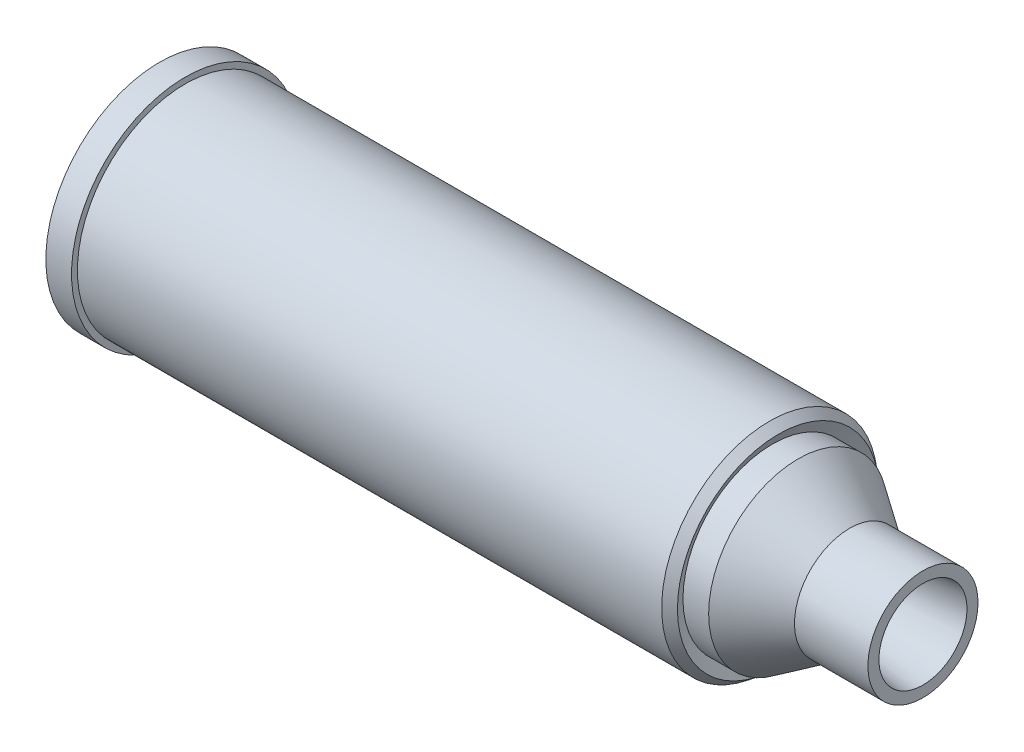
ISO-10303-21;
HEADER;
FILE_DESCRIPTION(('STEP AP214'),'2;1');
FILE_NAME('part.step','',(''),(''),'','','');
FILE_SCHEMA(('AUTOMOTIVE_DESIGN { 1 0 10303 214 1 1 1 1 }'));
ENDSEC;
DATA;
#1=APPLICATION_CONTEXT('core data for automotive mechanical design processes');
#2=APPLICATION_PROTOCOL_DEFINITION('international standard','automotive_design',2000,#1);
#3=PRODUCT_CONTEXT('',#1,'mechanical');
#4=PRODUCT('Part','Part','',(#3));
#5=PRODUCT_RELATED_PRODUCT_CATEGORY('part','',(#4));
#6=PRODUCT_DEFINITION_FORMATION('','',#4);
#7=PRODUCT_DEFINITION_CONTEXT('part definition',#1,'design');
#8=PRODUCT_DEFINITION('design','',#6,#7);
#9=PRODUCT_DEFINITION_SHAPE('','',#8);
#10=(LENGTH_UNIT() NAMED_UNIT(*) SI_UNIT(.MILLI.,.METRE.));
#11=(NAMED_UNIT(*) PLANE_ANGLE_UNIT() SI_UNIT($,.RADIAN.));
#12=(NAMED_UNIT(*) SI_UNIT($,.STERADIAN.) SOLID_ANGLE_UNIT());
#13=UNCERTAINTY_MEASURE_WITH_UNIT(LENGTH_MEASURE(1.E-05),#10,'distance_accuracy_value','');
#14=(GEOMETRIC_REPRESENTATION_CONTEXT(3) GLOBAL_UNCERTAINTY_ASSIGNED_CONTEXT((#13)) GLOBAL_UNIT_ASSIGNED_CONTEXT((#10,
#11,#12)) REPRESENTATION_CONTEXT('',''));
#15=CARTESIAN_POINT('',(0.,0.,0.));
#16=DIRECTION('',(0.,0.,1.));
#17=DIRECTION('',(1.,0.,0.));
#18=AXIS2_PLACEMENT_3D('',#15,#16,#17);
#19=CARTESIAN_POINT('',(43.9095744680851,0.,0.));
#20=DIRECTION('',(1.,0.,0.));
#21=DIRECTION('',(0.,0.,-1.));
#22=AXIS2_PLACEMENT_3D('',#19,#20,#21);
#23=CYLINDRICAL_SURFACE('',#22,9.15000000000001);
#24=CARTESIAN_POINT('',(0.,0.,0.));
#25=DIRECTION('',(1.,0.,0.));
#26=DIRECTION('',(0.,0.,-1.));
#27=AXIS2_PLACEMENT_3D('',#24,#25,#26);
#28=CIRCLE('',#27,9.15000000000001);
#29=CARTESIAN_POINT('',(0.,0.,-9.15000000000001));
#30=VERTEX_POINT('',#29);
#31=EDGE_CURVE('E18',#30,#30,#28,.T.);
#32=ORIENTED_EDGE('',*,*,#31,.F.);
#33=EDGE_LOOP('',(#32));
#34=FACE_BOUND('',#33,.T.);
#35=CARTESIAN_POINT('',(87.8191489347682,0.,0.));
#36=DIRECTION('',(-1.,0.,0.));
#37=DIRECTION('',(0.,1.,0.));
#38=AXIS2_PLACEMENT_3D('',#35,#36,#37);
#39=CIRCLE('',#38,9.14999999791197);
#40=CARTESIAN_POINT('',(87.8191489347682,9.14999999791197,0.));
#41=VERTEX_POINT('',#40);
#42=EDGE_CURVE('E31',#41,#41,#39,.F.);
#43=ORIENTED_EDGE('',*,*,#42,.T.);
#44=EDGE_LOOP('',(#43));
#45=FACE_BOUND('',#44,.T.);
#46=ADVANCED_FACE('F14',(#34,#45),#23,.F.);
#47=CARTESIAN_POINT('',(87.8191489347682,0.,0.));
#48=DIRECTION('',(-1.,0.,0.));
#49=DIRECTION('',(0.,0.,1.));
#50=AXIS2_PLACEMENT_3D('',#47,#48,#49);
#51=CONICAL_SURFACE('',#50,9.14999999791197,0.591292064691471);
#52=ORIENTED_EDGE('',*,*,#42,.F.);
#53=EDGE_LOOP('',(#52));
#54=FACE_BOUND('',#53,.T.);
#55=CARTESIAN_POINT('',(93.9999999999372,0.,0.));
#56=DIRECTION('',(1.,0.,0.));
#57=DIRECTION('',(0.,1.,0.));
#58=AXIS2_PLACEMENT_3D('',#55,#56,#57);
#59=CIRCLE('',#58,5.0000000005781);
#60=CARTESIAN_POINT('',(93.9999999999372,5.0000000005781,0.));
#61=VERTEX_POINT('',#60);
#62=EDGE_CURVE('E59',#61,#61,#59,.T.);
#63=ORIENTED_EDGE('',*,*,#62,.T.);
#64=EDGE_LOOP('',(#63));
#65=FACE_BOUND('',#64,.T.);
#66=ADVANCED_FACE('F157',(#54,#65),#51,.F.);
#67=CARTESIAN_POINT('',(0.,9.65,0.));
#68=DIRECTION('',(-1.,0.,0.));
#69=DIRECTION('',(0.,0.,1.));
#70=AXIS2_PLACEMENT_3D('',#67,#68,#69);
#71=PLANE('',#70);
#72=ORIENTED_EDGE('',*,*,#31,.T.);
#73=EDGE_LOOP('',(#72));
#74=FACE_BOUND('',#73,.T.);
#75=CARTESIAN_POINT('',(-9.02194985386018E-11,0.,0.));
#76=DIRECTION('',(1.,0.,0.));
#77=DIRECTION('',(0.,0.,-1.));
#78=AXIS2_PLACEMENT_3D('',#75,#76,#77);
#79=CIRCLE('',#78,9.35000000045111);
#80=CARTESIAN_POINT('',(-9.02194985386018E-11,0.,-9.35000000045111));
#81=VERTEX_POINT('',#80);
#82=EDGE_CURVE('E57',#81,#81,#79,.T.);
#83=ORIENTED_EDGE('',*,*,#82,.F.);
#84=EDGE_LOOP('',(#83));
#85=FACE_BOUND('',#84,.T.);
#86=ADVANCED_FACE('F152',(#74,#85),#71,.T.);
#87=CARTESIAN_POINT('',(104.000000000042,0.,0.));
#88=DIRECTION('',(1.,0.,0.));
#89=DIRECTION('',(0.,0.,-1.));
#90=AXIS2_PLACEMENT_3D('',#87,#88,#89);
#91=CONICAL_SURFACE('',#90,5.9999999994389,0.0996686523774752);
#92=ORIENTED_EDGE('',*,*,#62,.F.);
#93=EDGE_LOOP('',(#92));
#94=FACE_BOUND('',#93,.T.);
#95=CARTESIAN_POINT('',(104.000000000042,0.,0.));
#96=DIRECTION('',(1.,0.,0.));
#97=DIRECTION('',(0.,0.,-1.));
#98=AXIS2_PLACEMENT_3D('',#95,#96,#97);
#99=CIRCLE('',#98,5.9999999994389);
#100=CARTESIAN_POINT('',(104.000000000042,0.,-5.9999999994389));
#101=VERTEX_POINT('',#100);
#102=EDGE_CURVE('E55',#101,#101,#99,.F.);
#103=ORIENTED_EDGE('',*,*,#102,.F.);
#104=EDGE_LOOP('',(#103));
#105=FACE_BOUND('',#104,.T.);
#106=ADVANCED_FACE('F148',(#94,#105),#91,.F.);
#107=CARTESIAN_POINT('',(4.00000000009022,0.,0.));
#108=DIRECTION('',(1.,0.,0.));
#109=DIRECTION('',(0.,0.,-1.));
#110=AXIS2_PLACEMENT_3D('',#107,#108,#109);
#111=CONICAL_SURFACE('',#110,10.1499999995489,0.197395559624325);
#112=ORIENTED_EDGE('',*,*,#82,.T.);
#113=EDGE_LOOP('',(#112));
#114=FACE_BOUND('',#113,.T.);
#115=CARTESIAN_POINT('',(4.,0.,0.));
#116=DIRECTION('',(1.,0.,0.));
#117=DIRECTION('',(0.,0.,-1.));
#118=AXIS2_PLACEMENT_3D('',#115,#116,#117);
#119=CIRCLE('',#118,10.15);
#120=CARTESIAN_POINT('',(4.,0.,-10.15));
#121=VERTEX_POINT('',#120);
#122=EDGE_CURVE('E54',#121,#121,#119,.T.);
#123=ORIENTED_EDGE('',*,*,#122,.F.);
#124=EDGE_LOOP('',(#123));
#125=FACE_BOUND('',#124,.T.);
#126=ADVANCED_FACE('F143',(#114,#125),#111,.T.);
#127=CARTESIAN_POINT('',(104.,6.75,0.));
#128=DIRECTION('',(1.,0.,0.));
#129=DIRECTION('',(0.,0.,-1.));
#130=AXIS2_PLACEMENT_3D('',#127,#128,#129);
#131=PLANE('',#130);
#132=ORIENTED_EDGE('',*,*,#102,.T.);
#133=EDGE_LOOP('',(#132));
#134=FACE_BOUND('',#133,.T.);
#135=CARTESIAN_POINT('',(104.,0.,0.));
#136=DIRECTION('',(1.,0.,0.));
#137=DIRECTION('',(0.,0.,-1.));
#138=AXIS2_PLACEMENT_3D('',#135,#136,#137);
#139=CIRCLE('',#138,7.50000000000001);
#140=CARTESIAN_POINT('',(104.,0.,-7.50000000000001));
#141=VERTEX_POINT('',#140);
#142=EDGE_CURVE('E51',#141,#141,#139,.F.);
#143=ORIENTED_EDGE('',*,*,#142,.F.);
#144=EDGE_LOOP('',(#143));
#145=FACE_BOUND('',#144,.T.);
#146=ADVANCED_FACE('F138',(#134,#145),#131,.T.);
#147=CARTESIAN_POINT('',(40.,0.,0.));
#148=DIRECTION('',(1.,0.,0.));
#149=DIRECTION('',(0.,0.,-1.));
#150=AXIS2_PLACEMENT_3D('',#147,#148,#149);
#151=CYLINDRICAL_SURFACE('',#150,10.15);
#152=CARTESIAN_POINT('',(80.,0.,0.));
#153=DIRECTION('',(1.,0.,0.));
#154=DIRECTION('',(0.,0.,-1.));
#155=AXIS2_PLACEMENT_3D('',#152,#153,#154);
#156=CIRCLE('',#155,10.15);
#157=CARTESIAN_POINT('',(80.,0.,-10.15));
#158=VERTEX_POINT('',#157);
#159=EDGE_CURVE('E48',#158,#158,#156,.T.);
#160=ORIENTED_EDGE('',*,*,#159,.F.);
#161=EDGE_LOOP('',(#160));
#162=FACE_BOUND('',#161,.T.);
#163=ORIENTED_EDGE('',*,*,#122,.T.);
#164=EDGE_LOOP('',(#163));
#165=FACE_BOUND('',#164,.T.);
#166=ADVANCED_FACE('F133',(#162,#165),#151,.T.);
#167=CARTESIAN_POINT('',(99.,0.,0.));
#168=DIRECTION('',(1.,0.,0.));
#169=DIRECTION('',(0.,0.,-1.));
#170=AXIS2_PLACEMENT_3D('',#167,#168,#169);
#171=CYLINDRICAL_SURFACE('',#170,7.50000000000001);
#172=ORIENTED_EDGE('',*,*,#142,.T.);
#173=EDGE_LOOP('',(#172));
#174=FACE_BOUND('',#173,.T.);
#175=CARTESIAN_POINT('',(94.0000000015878,0.,0.));
#176=DIRECTION('',(-1.,0.,0.));
#177=DIRECTION('',(0.,1.,0.));
#178=AXIS2_PLACEMENT_3D('',#175,#176,#177);
#179=CIRCLE('',#178,7.50000000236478);
#180=CARTESIAN_POINT('',(94.0000000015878,7.50000000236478,0.));
#181=VERTEX_POINT('',#180);
#182=EDGE_CURVE('E47',#181,#181,#179,.T.);
#183=ORIENTED_EDGE('',*,*,#182,.F.);
#184=EDGE_LOOP('',(#183));
#185=FACE_BOUND('',#184,.T.);
#186=ADVANCED_FACE('F128',(#174,#185),#171,.T.);
#187=CARTESIAN_POINT('',(80.,11.825,0.));
#188=DIRECTION('',(-1.,0.,0.));
#189=DIRECTION('',(0.,0.,1.));
#190=AXIS2_PLACEMENT_3D('',#187,#188,#189);
#191=PLANE('',#190);
#192=ORIENTED_EDGE('',*,*,#159,.T.);
#193=EDGE_LOOP('',(#192));
#194=FACE_BOUND('',#193,.T.);
#195=CARTESIAN_POINT('',(80.,0.,0.));
#196=DIRECTION('',(1.,0.,0.));
#197=DIRECTION('',(0.,0.,-1.));
#198=AXIS2_PLACEMENT_3D('',#195,#196,#197);
#199=CIRCLE('',#198,13.5);
#200=CARTESIAN_POINT('',(80.,0.,-13.5));
#201=VERTEX_POINT('',#200);
#202=EDGE_CURVE('E44',#201,#201,#199,.F.);
#203=ORIENTED_EDGE('',*,*,#202,.T.);
#204=EDGE_LOOP('',(#203));
#205=FACE_BOUND('',#204,.T.);
#206=ADVANCED_FACE('F123',(#194,#205),#191,.T.);
#207=CARTESIAN_POINT('',(86.9999999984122,0.,0.));
#208=DIRECTION('',(-1.,0.,0.));
#209=DIRECTION('',(0.,0.,1.));
#210=AXIS2_PLACEMENT_3D('',#207,#208,#209);
#211=CONICAL_SURFACE('',#210,12.1999999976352,0.591292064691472);
#212=ORIENTED_EDGE('',*,*,#182,.T.);
#213=EDGE_LOOP('',(#212));
#214=FACE_BOUND('',#213,.T.);
#215=CARTESIAN_POINT('',(87.,0.,0.));
#216=DIRECTION('',(1.,0.,0.));
#217=DIRECTION('',(0.,0.,-1.));
#218=AXIS2_PLACEMENT_3D('',#215,#216,#217);
#219=CIRCLE('',#218,12.2);
#220=CARTESIAN_POINT('',(87.,0.,-12.2));
#221=VERTEX_POINT('',#220);
#222=EDGE_CURVE('E43',#221,#221,#219,.F.);
#223=ORIENTED_EDGE('',*,*,#222,.F.);
#224=EDGE_LOOP('',(#223));
#225=FACE_BOUND('',#224,.T.);
#226=ADVANCED_FACE('F118',(#214,#225),#211,.T.);
#227=CARTESIAN_POINT('',(40.,0.,0.));
#228=DIRECTION('',(1.,0.,0.));
#229=DIRECTION('',(0.,0.,-1.));
#230=AXIS2_PLACEMENT_3D('',#227,#228,#229);
#231=CYLINDRICAL_SURFACE('',#230,13.5);
#232=CARTESIAN_POINT('',(0.,0.,0.));
#233=DIRECTION('',(1.,0.,0.));
#234=DIRECTION('',(0.,0.,-1.));
#235=AXIS2_PLACEMENT_3D('',#232,#233,#234);
#236=CIRCLE('',#235,13.5);
#237=CARTESIAN_POINT('',(0.,0.,-13.5));
#238=VERTEX_POINT('',#237);
#239=EDGE_CURVE('E40',#238,#238,#236,.T.);
#240=ORIENTED_EDGE('',*,*,#239,.F.);
#241=EDGE_LOOP('',(#240));
#242=FACE_BOUND('',#241,.T.);
#243=ORIENTED_EDGE('',*,*,#202,.F.);
#244=EDGE_LOOP('',(#243));
#245=FACE_BOUND('',#244,.T.);
#246=ADVANCED_FACE('F113',(#242,#245),#231,.F.);
#247=CARTESIAN_POINT('',(85.25,0.,0.));
#248=DIRECTION('',(1.,0.,0.));
#249=DIRECTION('',(0.,0.,-1.));
#250=AXIS2_PLACEMENT_3D('',#247,#248,#249);
#251=CYLINDRICAL_SURFACE('',#250,12.2);
#252=ORIENTED_EDGE('',*,*,#222,.T.);
#253=EDGE_LOOP('',(#252));
#254=FACE_BOUND('',#253,.T.);
#255=CARTESIAN_POINT('',(83.4999999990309,0.,0.));
#256=DIRECTION('',(1.,0.,0.));
#257=DIRECTION('',(0.,1.,0.));
#258=AXIS2_PLACEMENT_3D('',#255,#256,#257);
#259=CIRCLE('',#258,12.2000000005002);
#260=CARTESIAN_POINT('',(83.4999999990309,12.2000000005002,0.));
#261=VERTEX_POINT('',#260);
#262=EDGE_CURVE('E39',#261,#261,#259,.T.);
#263=ORIENTED_EDGE('',*,*,#262,.T.);
#264=EDGE_LOOP('',(#263));
#265=FACE_BOUND('',#264,.T.);
#266=ADVANCED_FACE('F92',(#254,#265),#251,.T.);
#267=CARTESIAN_POINT('',(0.,14.5,0.));
#268=DIRECTION('',(-1.,0.,0.));
#269=DIRECTION('',(0.,0.,1.));
#270=AXIS2_PLACEMENT_3D('',#267,#268,#269);
#271=PLANE('',#270);
#272=ORIENTED_EDGE('',*,*,#239,.T.);
#273=EDGE_LOOP('',(#272));
#274=FACE_BOUND('',#273,.T.);
#275=CARTESIAN_POINT('',(0.,0.,0.));
#276=DIRECTION('',(1.,0.,0.));
#277=DIRECTION('',(0.,0.,-1.));
#278=AXIS2_PLACEMENT_3D('',#275,#276,#277);
#279=CIRCLE('',#278,15.5);
#280=CARTESIAN_POINT('',(0.,0.,-15.5));
#281=VERTEX_POINT('',#280);
#282=EDGE_CURVE('E36',#281,#281,#279,.T.);
#283=ORIENTED_EDGE('',*,*,#282,.F.);
#284=EDGE_LOOP('',(#283));
#285=FACE_BOUND('',#284,.T.);
#286=ADVANCED_FACE('F83',(#274,#285),#271,.T.);
#287=CARTESIAN_POINT('',(84.3000000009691,0.,0.));
#288=DIRECTION('',(1.,0.,0.));
#289=DIRECTION('',(0.,0.,-1.));
#290=AXIS2_PLACEMENT_3D('',#287,#288,#289);
#291=CONICAL_SURFACE('',#290,13.7499999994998,1.09432890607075);
#292=ORIENTED_EDGE('',*,*,#262,.F.);
#293=EDGE_LOOP('',(#292));
#294=FACE_BOUND('',#293,.T.);
#295=CARTESIAN_POINT('',(84.3000000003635,0.,0.));
#296=DIRECTION('',(-1.,0.,0.));
#297=DIRECTION('',(0.,-1.,0.));
#298=AXIS2_PLACEMENT_3D('',#295,#296,#297);
#299=CIRCLE('',#298,13.7500000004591);
#300=CARTESIAN_POINT('',(84.3000000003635,-13.7500000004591,0.));
#301=VERTEX_POINT('',#300);
#302=EDGE_CURVE('E35',#301,#301,#299,.T.);
#303=ORIENTED_EDGE('',*,*,#302,.F.);
#304=EDGE_LOOP('',(#303));
#305=FACE_BOUND('',#304,.T.);
#306=ADVANCED_FACE('F80',(#294,#305),#291,.F.);
#307=CARTESIAN_POINT('',(1.75,0.,0.));
#308=DIRECTION('',(1.,0.,0.));
#309=DIRECTION('',(0.,0.,-1.));
#310=AXIS2_PLACEMENT_3D('',#307,#308,#309);
#311=CYLINDRICAL_SURFACE('',#310,15.5);
#312=CARTESIAN_POINT('',(3.5,0.,0.));
#313=DIRECTION('',(1.,0.,0.));
#314=DIRECTION('',(0.,0.,-1.));
#315=AXIS2_PLACEMENT_3D('',#312,#313,#314);
#316=CIRCLE('',#315,15.5);
#317=CARTESIAN_POINT('',(3.5,0.,-15.5));
#318=VERTEX_POINT('',#317);
#319=EDGE_CURVE('E27',#318,#318,#316,.T.);
#320=ORIENTED_EDGE('',*,*,#319,.F.);
#321=EDGE_LOOP('',(#320));
#322=FACE_BOUND('',#321,.T.);
#323=ORIENTED_EDGE('',*,*,#282,.T.);
#324=EDGE_LOOP('',(#323));
#325=FACE_BOUND('',#324,.T.);
#326=ADVANCED_FACE('F82',(#322,#325),#311,.T.);
#327=CARTESIAN_POINT('',(83.0999999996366,0.,0.));
#328=DIRECTION('',(-1.,0.,0.));
#329=DIRECTION('',(0.,0.,1.));
#330=AXIS2_PLACEMENT_3D('',#327,#328,#329);
#331=CONICAL_SURFACE('',#330,14.6999999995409,0.669638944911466);
#332=CARTESIAN_POINT('',(83.1,0.,0.));
#333=DIRECTION('',(1.,0.,0.));
#334=DIRECTION('',(0.,0.,-1.));
#335=AXIS2_PLACEMENT_3D('',#332,#333,#334);
#336=CIRCLE('',#335,14.7);
#337=CARTESIAN_POINT('',(83.1,0.,-14.7));
#338=VERTEX_POINT('',#337);
#339=EDGE_CURVE('E22',#338,#338,#336,.F.);
#340=ORIENTED_EDGE('',*,*,#339,.F.);
#341=EDGE_LOOP('',(#340));
#342=FACE_BOUND('',#341,.T.);
#343=ORIENTED_EDGE('',*,*,#302,.T.);
#344=EDGE_LOOP('',(#343));
#345=FACE_BOUND('',#344,.T.);
#346=ADVANCED_FACE('F78',(#342,#345),#331,.T.);
#347=CARTESIAN_POINT('',(3.5,15.1,0.));
#348=DIRECTION('',(1.,0.,0.));
#349=DIRECTION('',(0.,0.,-1.));
#350=AXIS2_PLACEMENT_3D('',#347,#348,#349);
#351=PLANE('',#350);
#352=CARTESIAN_POINT('',(3.5,0.,0.));
#353=DIRECTION('',(1.,0.,0.));
#354=DIRECTION('',(0.,0.,-1.));
#355=AXIS2_PLACEMENT_3D('',#352,#353,#354);
#356=CIRCLE('',#355,14.7);
#357=CARTESIAN_POINT('',(3.5,0.,-14.7));
#358=VERTEX_POINT('',#357);
#359=EDGE_CURVE('E9',#358,#358,#356,.T.);
#360=ORIENTED_EDGE('',*,*,#359,.F.);
#361=EDGE_LOOP('',(#360));
#362=FACE_BOUND('',#361,.T.);
#363=ORIENTED_EDGE('',*,*,#319,.T.);
#364=EDGE_LOOP('',(#363));
#365=FACE_BOUND('',#364,.T.);
#366=ADVANCED_FACE('F97',(#362,#365),#351,.T.);
#367=CARTESIAN_POINT('',(43.9,0.,0.));
#368=DIRECTION('',(1.,0.,0.));
#369=DIRECTION('',(0.,0.,-1.));
#370=AXIS2_PLACEMENT_3D('',#367,#368,#369);
#371=CYLINDRICAL_SURFACE('',#370,14.7);
#372=ORIENTED_EDGE('',*,*,#339,.T.);
#373=EDGE_LOOP('',(#372));
#374=FACE_BOUND('',#373,.T.);
#375=ORIENTED_EDGE('',*,*,#359,.T.);
#376=EDGE_LOOP('',(#375));
#377=FACE_BOUND('',#376,.T.);
#378=ADVANCED_FACE('F16',(#374,#377),#371,.T.);
#379=CLOSED_SHELL('',(#46,#66,#86,#106,#126,#146,#166,#186,#206,#226,#246,#266,#286,#306,#326,
#346,#366,#378));
#380=MANIFOLD_SOLID_BREP('B1',#379);
#381=ADVANCED_BREP_SHAPE_REPRESENTATION('',(#18,#380),#14);
#382=SHAPE_DEFINITION_REPRESENTATION(#9,#381);
ENDSEC;
END-ISO-10303-21;
